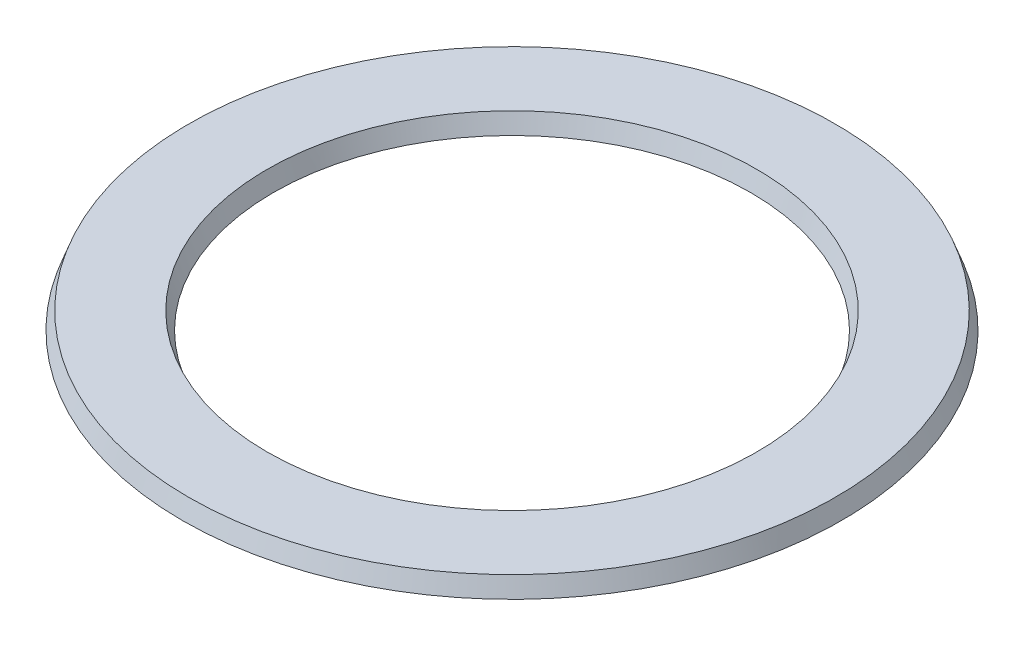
from build123d import *


with BuildPart() as part:
    # Esquisse1 → R_volution1 (revolve)
    with BuildSketch(Plane.XY, mode=Mode.PRIVATE) as r_volution1_sk:
        Polygon((-21, 0), (-29, 0), (-28.454044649, 1.5), (-21.545955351, 1.5), align=None)
    revolve(r_volution1_sk.sketch.rotate(Axis((0, 18.077517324, 0), (0, -1, 0)), 270), axis=Axis((0, 18.077517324, 0), (0, -1, 0)))


solid = part.part
